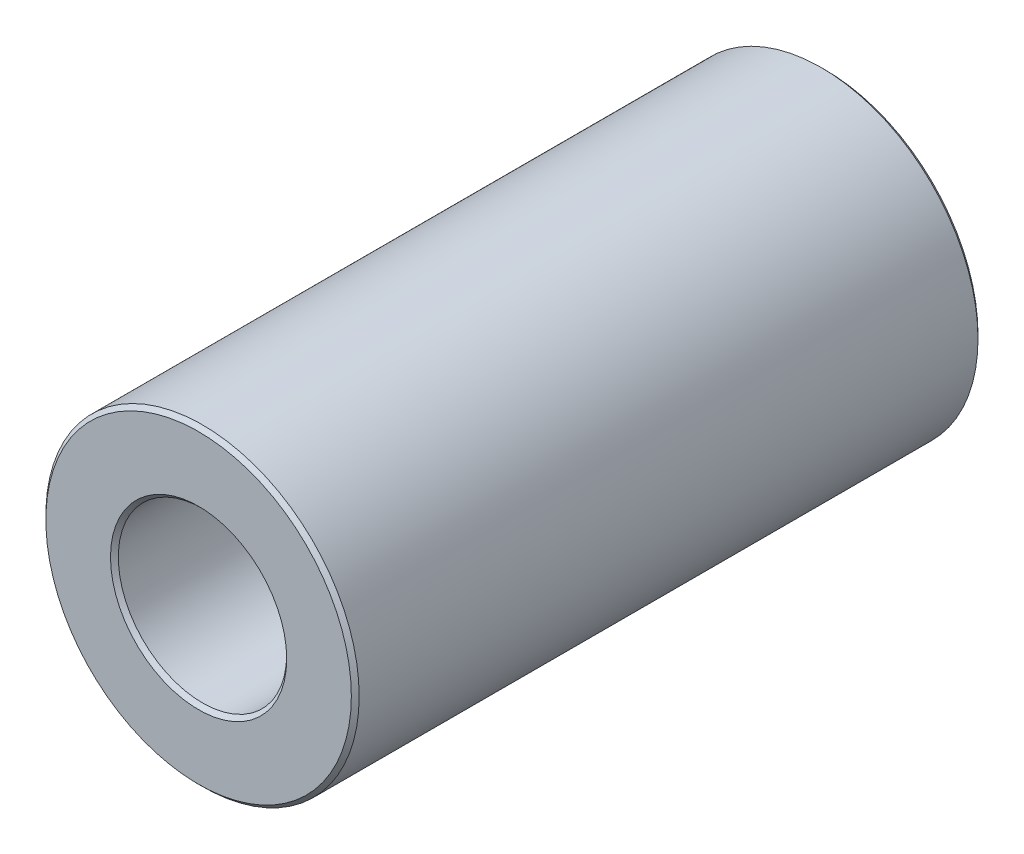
from build123d import *

# Parameters (mm, degrees)
SKETCH1_R           = 4
SKETCH1_R_2         = 2.15
BOSS_EXTRUDE2_DEPTH = 8
CHAMFER3_SIZE       = 0.1


with BuildPart() as part:
    # Sketch1 → Boss-Extrude2 (new, symmetric)
    with BuildSketch(Plane.XY):
        Circle(SKETCH1_R)
        Circle(SKETCH1_R_2, mode=Mode.SUBTRACT)
    extrude(amount=BOSS_EXTRUDE2_DEPTH, both=True)

    # Chamfer3
    chamfer3_edges = [part.edges().sort_by_distance(p)[0] for p in [
        (-4, 0, -8),
        (-4, 0, 8),
        (-2.15, 0, -8),
        (-2.15, 0, 8),
    ]]
    chamfer(chamfer3_edges, length=CHAMFER3_SIZE)


solid = part.part
